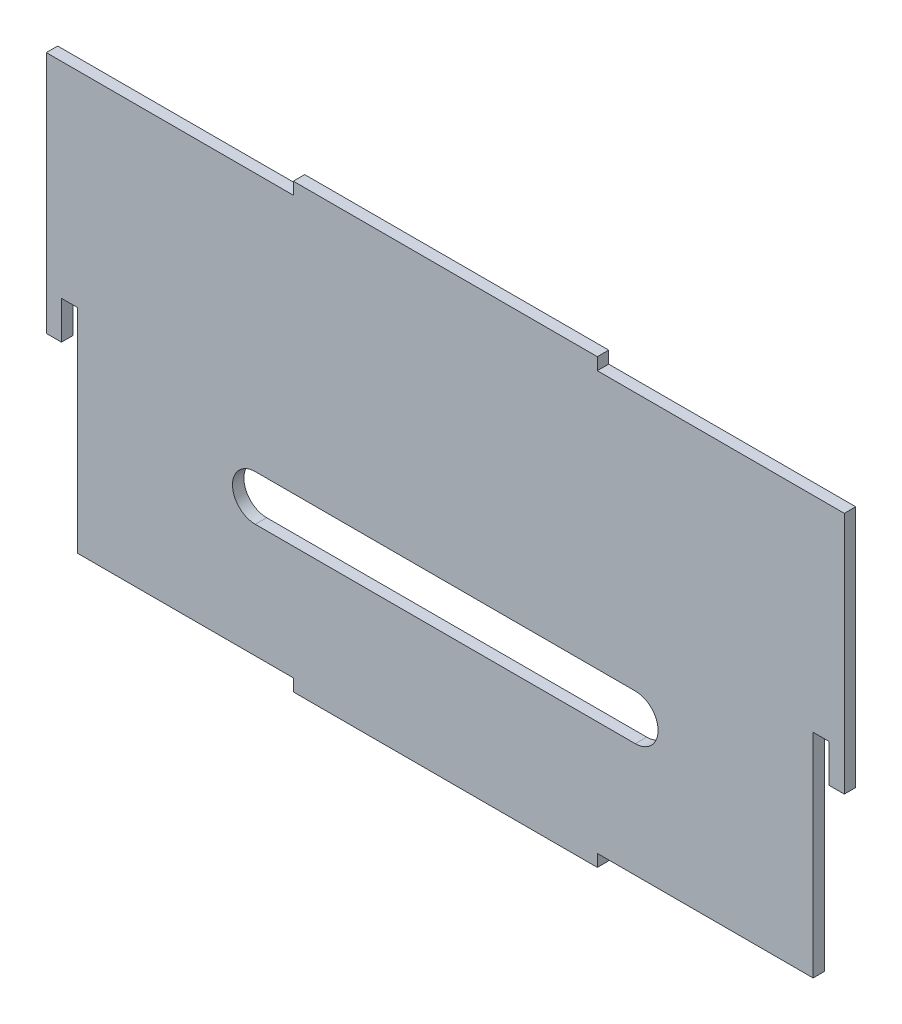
ISO-10303-21;
HEADER;
FILE_DESCRIPTION(('STEP AP214'),'2;1');
FILE_NAME('part.step','',(''),(''),'','','');
FILE_SCHEMA(('AUTOMOTIVE_DESIGN { 1 0 10303 214 1 1 1 1 }'));
ENDSEC;
DATA;
#1=APPLICATION_CONTEXT('core data for automotive mechanical design processes');
#2=APPLICATION_PROTOCOL_DEFINITION('international standard','automotive_design',2000,#1);
#3=PRODUCT_CONTEXT('',#1,'mechanical');
#4=PRODUCT('Part','Part','',(#3));
#5=PRODUCT_RELATED_PRODUCT_CATEGORY('part','',(#4));
#6=PRODUCT_DEFINITION_FORMATION('','',#4);
#7=PRODUCT_DEFINITION_CONTEXT('part definition',#1,'design');
#8=PRODUCT_DEFINITION('design','',#6,#7);
#9=PRODUCT_DEFINITION_SHAPE('','',#8);
#10=(LENGTH_UNIT() NAMED_UNIT(*) SI_UNIT(.MILLI.,.METRE.));
#11=(NAMED_UNIT(*) PLANE_ANGLE_UNIT() SI_UNIT($,.RADIAN.));
#12=(NAMED_UNIT(*) SI_UNIT($,.STERADIAN.) SOLID_ANGLE_UNIT());
#13=UNCERTAINTY_MEASURE_WITH_UNIT(LENGTH_MEASURE(1.E-05),#10,'distance_accuracy_value','');
#14=(GEOMETRIC_REPRESENTATION_CONTEXT(3) GLOBAL_UNCERTAINTY_ASSIGNED_CONTEXT((#13)) GLOBAL_UNIT_ASSIGNED_CONTEXT((#10,
#11,#12)) REPRESENTATION_CONTEXT('',''));
#15=CARTESIAN_POINT('',(0.,0.,0.));
#16=DIRECTION('',(0.,0.,1.));
#17=DIRECTION('',(1.,0.,0.));
#18=AXIS2_PLACEMENT_3D('',#15,#16,#17);
#19=CARTESIAN_POINT('',(0.,0.,1.5));
#20=DIRECTION('',(0.,0.,1.));
#21=DIRECTION('',(1.,0.,0.));
#22=AXIS2_PLACEMENT_3D('',#19,#20,#21);
#23=PLANE('',#22);
#24=DIRECTION('',(-1.,0.,0.));
#25=VECTOR('',#24,1.);
#26=CARTESIAN_POINT('',(-52.5,-4.5,1.5));
#27=LINE('',#26,#25);
#28=CARTESIAN_POINT('',(-50.5,-4.5,1.5));
#29=VERTEX_POINT('',#28);
#30=CARTESIAN_POINT('',(-52.5,-4.5,1.5));
#31=VERTEX_POINT('',#30);
#32=EDGE_CURVE('E198',#29,#31,#27,.T.);
#33=ORIENTED_EDGE('',*,*,#32,.F.);
#34=DIRECTION('',(0.,1.,0.));
#35=VECTOR('',#34,1.);
#36=CARTESIAN_POINT('',(-50.5,-27.5,1.5));
#37=LINE('',#36,#35);
#38=CARTESIAN_POINT('',(-50.5,0.499999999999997,1.5));
#39=VERTEX_POINT('',#38);
#40=EDGE_CURVE('E206',#29,#39,#37,.T.);
#41=ORIENTED_EDGE('',*,*,#40,.T.);
#42=DIRECTION('',(1.,0.,0.));
#43=VECTOR('',#42,1.);
#44=CARTESIAN_POINT('',(-50.5,0.499999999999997,1.5));
#45=LINE('',#44,#43);
#46=CARTESIAN_POINT('',(-48.4,0.499999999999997,1.5));
#47=VERTEX_POINT('',#46);
#48=EDGE_CURVE('E219',#39,#47,#45,.T.);
#49=ORIENTED_EDGE('',*,*,#48,.T.);
#50=DIRECTION('',(0.,-1.,0.));
#51=VECTOR('',#50,1.);
#52=CARTESIAN_POINT('',(-48.4,-27.5,1.5));
#53=LINE('',#52,#51);
#54=CARTESIAN_POINT('',(-48.4,-27.5,1.5));
#55=VERTEX_POINT('',#54);
#56=EDGE_CURVE('E223',#47,#55,#53,.T.);
#57=ORIENTED_EDGE('',*,*,#56,.T.);
#58=DIRECTION('',(1.,0.,0.));
#59=VECTOR('',#58,1.);
#60=CARTESIAN_POINT('',(-48.4,-27.5,1.5));
#61=LINE('',#60,#59);
#62=CARTESIAN_POINT('',(-20.,-27.5,1.5));
#63=VERTEX_POINT('',#62);
#64=EDGE_CURVE('E231',#55,#63,#61,.T.);
#65=ORIENTED_EDGE('',*,*,#64,.T.);
#66=DIRECTION('',(0.,-1.,0.));
#67=VECTOR('',#66,1.);
#68=CARTESIAN_POINT('',(-20.,-27.5,1.5));
#69=LINE('',#68,#67);
#70=CARTESIAN_POINT('',(-20.,-29.1,1.5));
#71=VERTEX_POINT('',#70);
#72=EDGE_CURVE('E234',#63,#71,#69,.T.);
#73=ORIENTED_EDGE('',*,*,#72,.T.);
#74=DIRECTION('',(1.,0.,0.));
#75=VECTOR('',#74,1.);
#76=CARTESIAN_POINT('',(-20.,-29.1,1.5));
#77=LINE('',#76,#75);
#78=CARTESIAN_POINT('',(20.,-29.1,1.5));
#79=VERTEX_POINT('',#78);
#80=EDGE_CURVE('E237',#71,#79,#77,.T.);
#81=ORIENTED_EDGE('',*,*,#80,.T.);
#82=DIRECTION('',(0.,1.,0.));
#83=VECTOR('',#82,1.);
#84=CARTESIAN_POINT('',(20.,-27.5,1.5));
#85=LINE('',#84,#83);
#86=CARTESIAN_POINT('',(20.,-27.5,1.5));
#87=VERTEX_POINT('',#86);
#88=EDGE_CURVE('E240',#79,#87,#85,.T.);
#89=ORIENTED_EDGE('',*,*,#88,.T.);
#90=DIRECTION('',(1.,0.,0.));
#91=VECTOR('',#90,1.);
#92=CARTESIAN_POINT('',(20.,-27.5,1.5));
#93=LINE('',#92,#91);
#94=CARTESIAN_POINT('',(48.4,-27.5,1.5));
#95=VERTEX_POINT('',#94);
#96=EDGE_CURVE('E243',#87,#95,#93,.T.);
#97=ORIENTED_EDGE('',*,*,#96,.T.);
#98=DIRECTION('',(0.,1.,0.));
#99=VECTOR('',#98,1.);
#100=CARTESIAN_POINT('',(48.4,-27.5,1.5));
#101=LINE('',#100,#99);
#102=CARTESIAN_POINT('',(48.4,0.499999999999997,1.5));
#103=VERTEX_POINT('',#102);
#104=EDGE_CURVE('E246',#95,#103,#101,.T.);
#105=ORIENTED_EDGE('',*,*,#104,.T.);
#106=DIRECTION('',(1.,0.,0.));
#107=VECTOR('',#106,1.);
#108=CARTESIAN_POINT('',(50.5,0.499999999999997,1.5));
#109=LINE('',#108,#107);
#110=CARTESIAN_POINT('',(50.5,0.499999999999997,1.5));
#111=VERTEX_POINT('',#110);
#112=EDGE_CURVE('E249',#103,#111,#109,.T.);
#113=ORIENTED_EDGE('',*,*,#112,.T.);
#114=DIRECTION('',(0.,-1.,0.));
#115=VECTOR('',#114,1.);
#116=CARTESIAN_POINT('',(50.5,-27.5,1.5));
#117=LINE('',#116,#115);
#118=CARTESIAN_POINT('',(50.5,-4.5,1.5));
#119=VERTEX_POINT('',#118);
#120=EDGE_CURVE('E252',#111,#119,#117,.T.);
#121=ORIENTED_EDGE('',*,*,#120,.T.);
#122=DIRECTION('',(-1.,0.,0.));
#123=VECTOR('',#122,1.);
#124=CARTESIAN_POINT('',(52.5,-4.5,1.5));
#125=LINE('',#124,#123);
#126=CARTESIAN_POINT('',(52.5,-4.5,1.5));
#127=VERTEX_POINT('',#126);
#128=EDGE_CURVE('E414',#127,#119,#125,.T.);
#129=ORIENTED_EDGE('',*,*,#128,.F.);
#130=DIRECTION('',(0.,1.,0.));
#131=VECTOR('',#130,1.);
#132=CARTESIAN_POINT('',(52.5,27.5,1.5));
#133=LINE('',#132,#131);
#134=CARTESIAN_POINT('',(52.5,27.5,1.5));
#135=VERTEX_POINT('',#134);
#136=EDGE_CURVE('E256',#127,#135,#133,.T.);
#137=ORIENTED_EDGE('',*,*,#136,.T.);
#138=DIRECTION('',(-1.,0.,0.));
#139=VECTOR('',#138,1.);
#140=CARTESIAN_POINT('',(20.,27.5,1.5));
#141=LINE('',#140,#139);
#142=CARTESIAN_POINT('',(20.,27.5,1.5));
#143=VERTEX_POINT('',#142);
#144=EDGE_CURVE('E259',#135,#143,#141,.T.);
#145=ORIENTED_EDGE('',*,*,#144,.T.);
#146=DIRECTION('',(0.,1.,0.));
#147=VECTOR('',#146,1.);
#148=CARTESIAN_POINT('',(20.,27.5,1.5));
#149=LINE('',#148,#147);
#150=CARTESIAN_POINT('',(20.,29.1,1.5));
#151=VERTEX_POINT('',#150);
#152=EDGE_CURVE('E262',#143,#151,#149,.T.);
#153=ORIENTED_EDGE('',*,*,#152,.T.);
#154=DIRECTION('',(-1.,0.,0.));
#155=VECTOR('',#154,1.);
#156=CARTESIAN_POINT('',(-20.,29.1,1.5));
#157=LINE('',#156,#155);
#158=CARTESIAN_POINT('',(-20.,29.1,1.5));
#159=VERTEX_POINT('',#158);
#160=EDGE_CURVE('E265',#151,#159,#157,.T.);
#161=ORIENTED_EDGE('',*,*,#160,.T.);
#162=DIRECTION('',(0.,-1.,0.));
#163=VECTOR('',#162,1.);
#164=CARTESIAN_POINT('',(-20.,27.5,1.5));
#165=LINE('',#164,#163);
#166=CARTESIAN_POINT('',(-20.,27.5,1.5));
#167=VERTEX_POINT('',#166);
#168=EDGE_CURVE('E268',#159,#167,#165,.T.);
#169=ORIENTED_EDGE('',*,*,#168,.T.);
#170=DIRECTION('',(-1.,0.,0.));
#171=VECTOR('',#170,1.);
#172=CARTESIAN_POINT('',(-52.5,27.5,1.5));
#173=LINE('',#172,#171);
#174=CARTESIAN_POINT('',(-52.5,27.5,1.5));
#175=VERTEX_POINT('',#174);
#176=EDGE_CURVE('E225',#167,#175,#173,.T.);
#177=ORIENTED_EDGE('',*,*,#176,.T.);
#178=DIRECTION('',(0.,-1.,0.));
#179=VECTOR('',#178,1.);
#180=CARTESIAN_POINT('',(-52.5,27.5,1.5));
#181=LINE('',#180,#179);
#182=EDGE_CURVE('E209',#175,#31,#181,.T.);
#183=ORIENTED_EDGE('',*,*,#182,.T.);
#184=EDGE_LOOP('',(#33,#41,#49,#57,#65,#73,#81,#89,#97,#105,#113,#121,#129,#137,#145,#153,#161,
#169,#177,#183));
#185=FACE_BOUND('',#184,.T.);
#186=DIRECTION('',(-1.,0.,0.));
#187=VECTOR('',#186,1.);
#188=CARTESIAN_POINT('',(0.,-12.5,1.5));
#189=LINE('',#188,#187);
#190=CARTESIAN_POINT('',(25.,-12.5,1.5));
#191=VERTEX_POINT('',#190);
#192=CARTESIAN_POINT('',(-25.,-12.5,1.5));
#193=VERTEX_POINT('',#192);
#194=EDGE_CURVE('E463',#191,#193,#189,.T.);
#195=ORIENTED_EDGE('',*,*,#194,.T.);
#196=CARTESIAN_POINT('',(-25.,-9.50000000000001,1.5));
#197=DIRECTION('',(0.,0.,1.));
#198=DIRECTION('',(1.,0.,0.));
#199=AXIS2_PLACEMENT_3D('',#196,#197,#198);
#200=CIRCLE('',#199,3.);
#201=CARTESIAN_POINT('',(-25.,-6.50000000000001,1.5));
#202=VERTEX_POINT('',#201);
#203=EDGE_CURVE('E277',#193,#202,#200,.F.);
#204=ORIENTED_EDGE('',*,*,#203,.T.);
#205=DIRECTION('',(-1.,0.,0.));
#206=VECTOR('',#205,1.);
#207=CARTESIAN_POINT('',(0.,-6.50000000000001,1.5));
#208=LINE('',#207,#206);
#209=CARTESIAN_POINT('',(25.,-6.50000000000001,1.5));
#210=VERTEX_POINT('',#209);
#211=EDGE_CURVE('E456',#210,#202,#208,.T.);
#212=ORIENTED_EDGE('',*,*,#211,.F.);
#213=CARTESIAN_POINT('',(25.,-9.50000000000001,1.5));
#214=DIRECTION('',(0.,0.,1.));
#215=DIRECTION('',(1.,0.,0.));
#216=AXIS2_PLACEMENT_3D('',#213,#214,#215);
#217=CIRCLE('',#216,3.);
#218=EDGE_CURVE('E459',#210,#191,#217,.F.);
#219=ORIENTED_EDGE('',*,*,#218,.T.);
#220=EDGE_LOOP('',(#195,#204,#212,#219));
#221=FACE_BOUND('',#220,.T.);
#222=ADVANCED_FACE('F38',(#185,#221),#23,.T.);
#223=CARTESIAN_POINT('',(0.,0.,0.));
#224=DIRECTION('',(0.,0.,1.));
#225=DIRECTION('',(1.,0.,0.));
#226=AXIS2_PLACEMENT_3D('',#223,#224,#225);
#227=PLANE('',#226);
#228=DIRECTION('',(0.,1.,0.));
#229=VECTOR('',#228,1.);
#230=CARTESIAN_POINT('',(-50.5,-27.5,0.));
#231=LINE('',#230,#229);
#232=CARTESIAN_POINT('',(-50.5,-4.5,0.));
#233=VERTEX_POINT('',#232);
#234=CARTESIAN_POINT('',(-50.5,0.499999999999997,0.));
#235=VERTEX_POINT('',#234);
#236=EDGE_CURVE('E281',#233,#235,#231,.T.);
#237=ORIENTED_EDGE('',*,*,#236,.F.);
#238=DIRECTION('',(-1.,0.,0.));
#239=VECTOR('',#238,1.);
#240=CARTESIAN_POINT('',(0.,-4.50000000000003,0.));
#241=LINE('',#240,#239);
#242=CARTESIAN_POINT('',(-52.5,-4.5,0.));
#243=VERTEX_POINT('',#242);
#244=EDGE_CURVE('E54',#233,#243,#241,.T.);
#245=ORIENTED_EDGE('',*,*,#244,.T.);
#246=DIRECTION('',(0.,-1.,0.));
#247=VECTOR('',#246,1.);
#248=CARTESIAN_POINT('',(-52.5,27.5,0.));
#249=LINE('',#248,#247);
#250=CARTESIAN_POINT('',(-52.5,27.5,0.));
#251=VERTEX_POINT('',#250);
#252=EDGE_CURVE('E276',#251,#243,#249,.T.);
#253=ORIENTED_EDGE('',*,*,#252,.F.);
#254=DIRECTION('',(-1.,0.,0.));
#255=VECTOR('',#254,1.);
#256=CARTESIAN_POINT('',(-52.5,27.5,0.));
#257=LINE('',#256,#255);
#258=CARTESIAN_POINT('',(-20.,27.5,0.));
#259=VERTEX_POINT('',#258);
#260=EDGE_CURVE('E272',#259,#251,#257,.T.);
#261=ORIENTED_EDGE('',*,*,#260,.F.);
#262=DIRECTION('',(0.,-1.,0.));
#263=VECTOR('',#262,1.);
#264=CARTESIAN_POINT('',(-20.,27.5,0.));
#265=LINE('',#264,#263);
#266=CARTESIAN_POINT('',(-20.,29.1,0.));
#267=VERTEX_POINT('',#266);
#268=EDGE_CURVE('E327',#267,#259,#265,.T.);
#269=ORIENTED_EDGE('',*,*,#268,.F.);
#270=DIRECTION('',(-1.,0.,0.));
#271=VECTOR('',#270,1.);
#272=CARTESIAN_POINT('',(-20.,29.1,0.));
#273=LINE('',#272,#271);
#274=CARTESIAN_POINT('',(20.,29.1,0.));
#275=VERTEX_POINT('',#274);
#276=EDGE_CURVE('E324',#275,#267,#273,.T.);
#277=ORIENTED_EDGE('',*,*,#276,.F.);
#278=DIRECTION('',(0.,1.,0.));
#279=VECTOR('',#278,1.);
#280=CARTESIAN_POINT('',(20.,27.5,0.));
#281=LINE('',#280,#279);
#282=CARTESIAN_POINT('',(20.,27.5,0.));
#283=VERTEX_POINT('',#282);
#284=EDGE_CURVE('E321',#283,#275,#281,.T.);
#285=ORIENTED_EDGE('',*,*,#284,.F.);
#286=DIRECTION('',(-1.,0.,0.));
#287=VECTOR('',#286,1.);
#288=CARTESIAN_POINT('',(20.,27.5,0.));
#289=LINE('',#288,#287);
#290=CARTESIAN_POINT('',(52.5,27.5,0.));
#291=VERTEX_POINT('',#290);
#292=EDGE_CURVE('E318',#291,#283,#289,.T.);
#293=ORIENTED_EDGE('',*,*,#292,.F.);
#294=DIRECTION('',(0.,1.,0.));
#295=VECTOR('',#294,1.);
#296=CARTESIAN_POINT('',(52.5,27.5,0.));
#297=LINE('',#296,#295);
#298=CARTESIAN_POINT('',(52.5,-4.5,0.));
#299=VERTEX_POINT('',#298);
#300=EDGE_CURVE('E315',#299,#291,#297,.T.);
#301=ORIENTED_EDGE('',*,*,#300,.F.);
#302=DIRECTION('',(-1.,0.,0.));
#303=VECTOR('',#302,1.);
#304=CARTESIAN_POINT('',(0.,-4.50000000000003,0.));
#305=LINE('',#304,#303);
#306=CARTESIAN_POINT('',(50.5,-4.5,0.));
#307=VERTEX_POINT('',#306);
#308=EDGE_CURVE('E61',#299,#307,#305,.T.);
#309=ORIENTED_EDGE('',*,*,#308,.T.);
#310=DIRECTION('',(0.,-1.,0.));
#311=VECTOR('',#310,1.);
#312=CARTESIAN_POINT('',(50.5,-27.5,0.));
#313=LINE('',#312,#311);
#314=CARTESIAN_POINT('',(50.5,0.499999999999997,0.));
#315=VERTEX_POINT('',#314);
#316=EDGE_CURVE('E311',#315,#307,#313,.T.);
#317=ORIENTED_EDGE('',*,*,#316,.F.);
#318=DIRECTION('',(1.,0.,0.));
#319=VECTOR('',#318,1.);
#320=CARTESIAN_POINT('',(50.5,0.499999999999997,0.));
#321=LINE('',#320,#319);
#322=CARTESIAN_POINT('',(48.4,0.499999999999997,0.));
#323=VERTEX_POINT('',#322);
#324=EDGE_CURVE('E308',#323,#315,#321,.T.);
#325=ORIENTED_EDGE('',*,*,#324,.F.);
#326=DIRECTION('',(0.,1.,0.));
#327=VECTOR('',#326,1.);
#328=CARTESIAN_POINT('',(48.4,-27.5,0.));
#329=LINE('',#328,#327);
#330=CARTESIAN_POINT('',(48.4,-27.5,0.));
#331=VERTEX_POINT('',#330);
#332=EDGE_CURVE('E305',#331,#323,#329,.T.);
#333=ORIENTED_EDGE('',*,*,#332,.F.);
#334=DIRECTION('',(1.,0.,0.));
#335=VECTOR('',#334,1.);
#336=CARTESIAN_POINT('',(20.,-27.5,0.));
#337=LINE('',#336,#335);
#338=CARTESIAN_POINT('',(20.,-27.5,0.));
#339=VERTEX_POINT('',#338);
#340=EDGE_CURVE('E302',#339,#331,#337,.T.);
#341=ORIENTED_EDGE('',*,*,#340,.F.);
#342=DIRECTION('',(0.,1.,0.));
#343=VECTOR('',#342,1.);
#344=CARTESIAN_POINT('',(20.,-27.5,0.));
#345=LINE('',#344,#343);
#346=CARTESIAN_POINT('',(20.,-29.1,0.));
#347=VERTEX_POINT('',#346);
#348=EDGE_CURVE('E299',#347,#339,#345,.T.);
#349=ORIENTED_EDGE('',*,*,#348,.F.);
#350=DIRECTION('',(1.,0.,0.));
#351=VECTOR('',#350,1.);
#352=CARTESIAN_POINT('',(-20.,-29.1,0.));
#353=LINE('',#352,#351);
#354=CARTESIAN_POINT('',(-20.,-29.1,0.));
#355=VERTEX_POINT('',#354);
#356=EDGE_CURVE('E296',#355,#347,#353,.T.);
#357=ORIENTED_EDGE('',*,*,#356,.F.);
#358=DIRECTION('',(0.,-1.,0.));
#359=VECTOR('',#358,1.);
#360=CARTESIAN_POINT('',(-20.,-27.5,0.));
#361=LINE('',#360,#359);
#362=CARTESIAN_POINT('',(-20.,-27.5,0.));
#363=VERTEX_POINT('',#362);
#364=EDGE_CURVE('E293',#363,#355,#361,.T.);
#365=ORIENTED_EDGE('',*,*,#364,.F.);
#366=DIRECTION('',(1.,0.,0.));
#367=VECTOR('',#366,1.);
#368=CARTESIAN_POINT('',(-48.4,-27.5,0.));
#369=LINE('',#368,#367);
#370=CARTESIAN_POINT('',(-48.4,-27.5,0.));
#371=VERTEX_POINT('',#370);
#372=EDGE_CURVE('E290',#371,#363,#369,.T.);
#373=ORIENTED_EDGE('',*,*,#372,.F.);
#374=DIRECTION('',(0.,-1.,0.));
#375=VECTOR('',#374,1.);
#376=CARTESIAN_POINT('',(-48.4,-27.5,0.));
#377=LINE('',#376,#375);
#378=CARTESIAN_POINT('',(-48.4,0.499999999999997,0.));
#379=VERTEX_POINT('',#378);
#380=EDGE_CURVE('E287',#379,#371,#377,.T.);
#381=ORIENTED_EDGE('',*,*,#380,.F.);
#382=DIRECTION('',(1.,0.,0.));
#383=VECTOR('',#382,1.);
#384=CARTESIAN_POINT('',(-50.5,0.499999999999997,0.));
#385=LINE('',#384,#383);
#386=EDGE_CURVE('E284',#235,#379,#385,.T.);
#387=ORIENTED_EDGE('',*,*,#386,.F.);
#388=EDGE_LOOP('',(#237,#245,#253,#261,#269,#277,#285,#293,#301,#309,#317,#325,#333,#341,#349,
#357,#365,#373,#381,#387));
#389=FACE_BOUND('',#388,.T.);
#390=CARTESIAN_POINT('',(-25.,-9.50000000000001,0.));
#391=DIRECTION('',(0.,0.,1.));
#392=DIRECTION('',(1.,0.,0.));
#393=AXIS2_PLACEMENT_3D('',#390,#391,#392);
#394=CIRCLE('',#393,3.);
#395=CARTESIAN_POINT('',(-25.,-6.50000000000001,0.));
#396=VERTEX_POINT('',#395);
#397=CARTESIAN_POINT('',(-25.,-12.5,0.));
#398=VERTEX_POINT('',#397);
#399=EDGE_CURVE('E427',#396,#398,#394,.T.);
#400=ORIENTED_EDGE('',*,*,#399,.T.);
#401=DIRECTION('',(1.,0.,0.));
#402=VECTOR('',#401,1.);
#403=CARTESIAN_POINT('',(-25.,-12.5,0.));
#404=LINE('',#403,#402);
#405=CARTESIAN_POINT('',(25.,-12.5,0.));
#406=VERTEX_POINT('',#405);
#407=EDGE_CURVE('E431',#398,#406,#404,.T.);
#408=ORIENTED_EDGE('',*,*,#407,.T.);
#409=CARTESIAN_POINT('',(25.,-9.50000000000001,0.));
#410=DIRECTION('',(0.,0.,1.));
#411=DIRECTION('',(1.,0.,0.));
#412=AXIS2_PLACEMENT_3D('',#409,#410,#411);
#413=CIRCLE('',#412,3.);
#414=CARTESIAN_POINT('',(25.,-6.50000000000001,0.));
#415=VERTEX_POINT('',#414);
#416=EDGE_CURVE('E435',#406,#415,#413,.T.);
#417=ORIENTED_EDGE('',*,*,#416,.T.);
#418=DIRECTION('',(1.,0.,0.));
#419=VECTOR('',#418,1.);
#420=CARTESIAN_POINT('',(-25.,-6.50000000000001,0.));
#421=LINE('',#420,#419);
#422=EDGE_CURVE('E439',#396,#415,#421,.T.);
#423=ORIENTED_EDGE('',*,*,#422,.F.);
#424=EDGE_LOOP('',(#400,#408,#417,#423));
#425=FACE_BOUND('',#424,.T.);
#426=ADVANCED_FACE('F399',(#389,#425),#227,.F.);
#427=CARTESIAN_POINT('',(-52.5,27.5,1.5));
#428=DIRECTION('',(0.,-1.,0.));
#429=DIRECTION('',(1.,0.,0.));
#430=AXIS2_PLACEMENT_3D('',#427,#428,#429);
#431=PLANE('',#430);
#432=ORIENTED_EDGE('',*,*,#260,.T.);
#433=DIRECTION('',(0.,0.,-1.));
#434=VECTOR('',#433,1.);
#435=CARTESIAN_POINT('',(-52.5,27.5,1.5));
#436=LINE('',#435,#434);
#437=EDGE_CURVE('E387',#175,#251,#436,.T.);
#438=ORIENTED_EDGE('',*,*,#437,.F.);
#439=ORIENTED_EDGE('',*,*,#176,.F.);
#440=DIRECTION('',(0.,0.,-1.));
#441=VECTOR('',#440,1.);
#442=CARTESIAN_POINT('',(-20.,27.5,1.5));
#443=LINE('',#442,#441);
#444=EDGE_CURVE('E271',#167,#259,#443,.T.);
#445=ORIENTED_EDGE('',*,*,#444,.T.);
#446=EDGE_LOOP('',(#432,#438,#439,#445));
#447=FACE_BOUND('',#446,.T.);
#448=ADVANCED_FACE('F40',(#447),#431,.F.);
#449=CARTESIAN_POINT('',(-52.5,27.5,1.5));
#450=DIRECTION('',(1.,0.,0.));
#451=DIRECTION('',(0.,0.,-1.));
#452=AXIS2_PLACEMENT_3D('',#449,#450,#451);
#453=PLANE('',#452);
#454=ORIENTED_EDGE('',*,*,#252,.T.);
#455=DIRECTION('',(0.,0.,1.));
#456=VECTOR('',#455,1.);
#457=CARTESIAN_POINT('',(-52.5,-4.5,-8.5));
#458=LINE('',#457,#456);
#459=EDGE_CURVE('E211',#243,#31,#458,.T.);
#460=ORIENTED_EDGE('',*,*,#459,.T.);
#461=ORIENTED_EDGE('',*,*,#182,.F.);
#462=ORIENTED_EDGE('',*,*,#437,.T.);
#463=EDGE_LOOP('',(#454,#460,#461,#462));
#464=FACE_BOUND('',#463,.T.);
#465=ADVANCED_FACE('F477',(#464),#453,.F.);
#466=CARTESIAN_POINT('',(-50.5,-27.5,1.5));
#467=DIRECTION('',(-1.,0.,0.));
#468=DIRECTION('',(0.,-1.,0.));
#469=AXIS2_PLACEMENT_3D('',#466,#467,#468);
#470=PLANE('',#469);
#471=ORIENTED_EDGE('',*,*,#40,.F.);
#472=DIRECTION('',(0.,0.,-1.));
#473=VECTOR('',#472,1.);
#474=CARTESIAN_POINT('',(-50.5,-4.5,1.5));
#475=LINE('',#474,#473);
#476=EDGE_CURVE('E11',#29,#233,#475,.T.);
#477=ORIENTED_EDGE('',*,*,#476,.T.);
#478=ORIENTED_EDGE('',*,*,#236,.T.);
#479=DIRECTION('',(0.,0.,-1.));
#480=VECTOR('',#479,1.);
#481=CARTESIAN_POINT('',(-50.5,0.499999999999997,1.5));
#482=LINE('',#481,#480);
#483=EDGE_CURVE('E216',#39,#235,#482,.T.);
#484=ORIENTED_EDGE('',*,*,#483,.F.);
#485=EDGE_LOOP('',(#471,#477,#478,#484));
#486=FACE_BOUND('',#485,.T.);
#487=ADVANCED_FACE('F214',(#486),#470,.F.);
#488=CARTESIAN_POINT('',(-50.5,0.499999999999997,1.5));
#489=DIRECTION('',(0.,1.,0.));
#490=DIRECTION('',(0.,0.,1.));
#491=AXIS2_PLACEMENT_3D('',#488,#489,#490);
#492=PLANE('',#491);
#493=ORIENTED_EDGE('',*,*,#386,.T.);
#494=DIRECTION('',(0.,0.,-1.));
#495=VECTOR('',#494,1.);
#496=CARTESIAN_POINT('',(-48.4,0.499999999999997,1.5));
#497=LINE('',#496,#495);
#498=EDGE_CURVE('E381',#47,#379,#497,.T.);
#499=ORIENTED_EDGE('',*,*,#498,.F.);
#500=ORIENTED_EDGE('',*,*,#48,.F.);
#501=ORIENTED_EDGE('',*,*,#483,.T.);
#502=EDGE_LOOP('',(#493,#499,#500,#501));
#503=FACE_BOUND('',#502,.T.);
#504=ADVANCED_FACE('F482',(#503),#492,.F.);
#505=CARTESIAN_POINT('',(-48.4,-27.5,1.5));
#506=DIRECTION('',(1.,0.,0.));
#507=DIRECTION('',(0.,0.,-1.));
#508=AXIS2_PLACEMENT_3D('',#505,#506,#507);
#509=PLANE('',#508);
#510=ORIENTED_EDGE('',*,*,#380,.T.);
#511=DIRECTION('',(0.,0.,-1.));
#512=VECTOR('',#511,1.);
#513=CARTESIAN_POINT('',(-48.4,-27.5,1.5));
#514=LINE('',#513,#512);
#515=EDGE_CURVE('E377',#55,#371,#514,.T.);
#516=ORIENTED_EDGE('',*,*,#515,.F.);
#517=ORIENTED_EDGE('',*,*,#56,.F.);
#518=ORIENTED_EDGE('',*,*,#498,.T.);
#519=EDGE_LOOP('',(#510,#516,#517,#518));
#520=FACE_BOUND('',#519,.T.);
#521=ADVANCED_FACE('F489',(#520),#509,.F.);
#522=CARTESIAN_POINT('',(-48.4,-27.5,1.5));
#523=DIRECTION('',(0.,1.,0.));
#524=DIRECTION('',(-1.,0.,0.));
#525=AXIS2_PLACEMENT_3D('',#522,#523,#524);
#526=PLANE('',#525);
#527=ORIENTED_EDGE('',*,*,#372,.T.);
#528=DIRECTION('',(0.,0.,-1.));
#529=VECTOR('',#528,1.);
#530=CARTESIAN_POINT('',(-20.,-27.5,1.5));
#531=LINE('',#530,#529);
#532=EDGE_CURVE('E373',#63,#363,#531,.T.);
#533=ORIENTED_EDGE('',*,*,#532,.F.);
#534=ORIENTED_EDGE('',*,*,#64,.F.);
#535=ORIENTED_EDGE('',*,*,#515,.T.);
#536=EDGE_LOOP('',(#527,#533,#534,#535));
#537=FACE_BOUND('',#536,.T.);
#538=ADVANCED_FACE('F492',(#537),#526,.F.);
#539=CARTESIAN_POINT('',(-20.,-27.5,1.5));
#540=DIRECTION('',(1.,0.,0.));
#541=DIRECTION('',(0.,0.,-1.));
#542=AXIS2_PLACEMENT_3D('',#539,#540,#541);
#543=PLANE('',#542);
#544=ORIENTED_EDGE('',*,*,#364,.T.);
#545=DIRECTION('',(0.,0.,-1.));
#546=VECTOR('',#545,1.);
#547=CARTESIAN_POINT('',(-20.,-29.1,1.5));
#548=LINE('',#547,#546);
#549=EDGE_CURVE('E369',#71,#355,#548,.T.);
#550=ORIENTED_EDGE('',*,*,#549,.F.);
#551=ORIENTED_EDGE('',*,*,#72,.F.);
#552=ORIENTED_EDGE('',*,*,#532,.T.);
#553=EDGE_LOOP('',(#544,#550,#551,#552));
#554=FACE_BOUND('',#553,.T.);
#555=ADVANCED_FACE('F497',(#554),#543,.F.);
#556=CARTESIAN_POINT('',(-20.,-29.1,1.5));
#557=DIRECTION('',(0.,1.,0.));
#558=DIRECTION('',(-1.,0.,0.));
#559=AXIS2_PLACEMENT_3D('',#556,#557,#558);
#560=PLANE('',#559);
#561=ORIENTED_EDGE('',*,*,#356,.T.);
#562=DIRECTION('',(0.,0.,-1.));
#563=VECTOR('',#562,1.);
#564=CARTESIAN_POINT('',(20.,-29.1,1.5));
#565=LINE('',#564,#563);
#566=EDGE_CURVE('E365',#79,#347,#565,.T.);
#567=ORIENTED_EDGE('',*,*,#566,.F.);
#568=ORIENTED_EDGE('',*,*,#80,.F.);
#569=ORIENTED_EDGE('',*,*,#549,.T.);
#570=EDGE_LOOP('',(#561,#567,#568,#569));
#571=FACE_BOUND('',#570,.T.);
#572=ADVANCED_FACE('F503',(#571),#560,.F.);
#573=CARTESIAN_POINT('',(20.,-27.5,1.5));
#574=DIRECTION('',(-1.,0.,0.));
#575=DIRECTION('',(0.,0.,1.));
#576=AXIS2_PLACEMENT_3D('',#573,#574,#575);
#577=PLANE('',#576);
#578=ORIENTED_EDGE('',*,*,#348,.T.);
#579=DIRECTION('',(0.,0.,-1.));
#580=VECTOR('',#579,1.);
#581=CARTESIAN_POINT('',(20.,-27.5,1.5));
#582=LINE('',#581,#580);
#583=EDGE_CURVE('E361',#87,#339,#582,.T.);
#584=ORIENTED_EDGE('',*,*,#583,.F.);
#585=ORIENTED_EDGE('',*,*,#88,.F.);
#586=ORIENTED_EDGE('',*,*,#566,.T.);
#587=EDGE_LOOP('',(#578,#584,#585,#586));
#588=FACE_BOUND('',#587,.T.);
#589=ADVANCED_FACE('F507',(#588),#577,.F.);
#590=CARTESIAN_POINT('',(20.,-27.5,1.5));
#591=DIRECTION('',(0.,1.,0.));
#592=DIRECTION('',(-1.,0.,0.));
#593=AXIS2_PLACEMENT_3D('',#590,#591,#592);
#594=PLANE('',#593);
#595=ORIENTED_EDGE('',*,*,#340,.T.);
#596=DIRECTION('',(0.,0.,-1.));
#597=VECTOR('',#596,1.);
#598=CARTESIAN_POINT('',(48.4,-27.5,1.5));
#599=LINE('',#598,#597);
#600=EDGE_CURVE('E357',#95,#331,#599,.T.);
#601=ORIENTED_EDGE('',*,*,#600,.F.);
#602=ORIENTED_EDGE('',*,*,#96,.F.);
#603=ORIENTED_EDGE('',*,*,#583,.T.);
#604=EDGE_LOOP('',(#595,#601,#602,#603));
#605=FACE_BOUND('',#604,.T.);
#606=ADVANCED_FACE('F512',(#605),#594,.F.);
#607=CARTESIAN_POINT('',(48.4,-27.5,1.5));
#608=DIRECTION('',(-1.,0.,0.));
#609=DIRECTION('',(0.,0.,1.));
#610=AXIS2_PLACEMENT_3D('',#607,#608,#609);
#611=PLANE('',#610);
#612=ORIENTED_EDGE('',*,*,#332,.T.);
#613=DIRECTION('',(0.,0.,-1.));
#614=VECTOR('',#613,1.);
#615=CARTESIAN_POINT('',(48.4,0.499999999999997,1.5));
#616=LINE('',#615,#614);
#617=EDGE_CURVE('E353',#103,#323,#616,.T.);
#618=ORIENTED_EDGE('',*,*,#617,.F.);
#619=ORIENTED_EDGE('',*,*,#104,.F.);
#620=ORIENTED_EDGE('',*,*,#600,.T.);
#621=EDGE_LOOP('',(#612,#618,#619,#620));
#622=FACE_BOUND('',#621,.T.);
#623=ADVANCED_FACE('F518',(#622),#611,.F.);
#624=CARTESIAN_POINT('',(50.5,0.499999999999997,1.5));
#625=DIRECTION('',(0.,1.,0.));
#626=DIRECTION('',(0.,0.,1.));
#627=AXIS2_PLACEMENT_3D('',#624,#625,#626);
#628=PLANE('',#627);
#629=ORIENTED_EDGE('',*,*,#324,.T.);
#630=DIRECTION('',(0.,0.,-1.));
#631=VECTOR('',#630,1.);
#632=CARTESIAN_POINT('',(50.5,0.499999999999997,1.5));
#633=LINE('',#632,#631);
#634=EDGE_CURVE('E349',#111,#315,#633,.T.);
#635=ORIENTED_EDGE('',*,*,#634,.F.);
#636=ORIENTED_EDGE('',*,*,#112,.F.);
#637=ORIENTED_EDGE('',*,*,#617,.T.);
#638=EDGE_LOOP('',(#629,#635,#636,#637));
#639=FACE_BOUND('',#638,.T.);
#640=ADVANCED_FACE('F522',(#639),#628,.F.);
#641=CARTESIAN_POINT('',(50.5,-27.5,1.5));
#642=DIRECTION('',(1.,0.,0.));
#643=DIRECTION('',(0.,1.,0.));
#644=AXIS2_PLACEMENT_3D('',#641,#642,#643);
#645=PLANE('',#644);
#646=ORIENTED_EDGE('',*,*,#316,.T.);
#647=DIRECTION('',(0.,0.,1.));
#648=VECTOR('',#647,1.);
#649=CARTESIAN_POINT('',(50.5,-4.5,-8.5));
#650=LINE('',#649,#648);
#651=EDGE_CURVE('E212',#307,#119,#650,.T.);
#652=ORIENTED_EDGE('',*,*,#651,.T.);
#653=ORIENTED_EDGE('',*,*,#120,.F.);
#654=ORIENTED_EDGE('',*,*,#634,.T.);
#655=EDGE_LOOP('',(#646,#652,#653,#654));
#656=FACE_BOUND('',#655,.T.);
#657=ADVANCED_FACE('F524',(#656),#645,.F.);
#658=CARTESIAN_POINT('',(52.5,27.5,1.5));
#659=DIRECTION('',(-1.,0.,0.));
#660=DIRECTION('',(0.,-1.,0.));
#661=AXIS2_PLACEMENT_3D('',#658,#659,#660);
#662=PLANE('',#661);
#663=ORIENTED_EDGE('',*,*,#136,.F.);
#664=DIRECTION('',(0.,0.,-1.));
#665=VECTOR('',#664,1.);
#666=CARTESIAN_POINT('',(52.5,-4.5,1.5));
#667=LINE('',#666,#665);
#668=EDGE_CURVE('E47',#127,#299,#667,.T.);
#669=ORIENTED_EDGE('',*,*,#668,.T.);
#670=ORIENTED_EDGE('',*,*,#300,.T.);
#671=DIRECTION('',(0.,0.,-1.));
#672=VECTOR('',#671,1.);
#673=CARTESIAN_POINT('',(52.5,27.5,1.5));
#674=LINE('',#673,#672);
#675=EDGE_CURVE('E345',#135,#291,#674,.T.);
#676=ORIENTED_EDGE('',*,*,#675,.F.);
#677=EDGE_LOOP('',(#663,#669,#670,#676));
#678=FACE_BOUND('',#677,.T.);
#679=ADVANCED_FACE('F394',(#678),#662,.F.);
#680=CARTESIAN_POINT('',(20.,27.5,1.5));
#681=DIRECTION('',(0.,-1.,0.));
#682=DIRECTION('',(1.,0.,0.));
#683=AXIS2_PLACEMENT_3D('',#680,#681,#682);
#684=PLANE('',#683);
#685=ORIENTED_EDGE('',*,*,#292,.T.);
#686=DIRECTION('',(0.,0.,-1.));
#687=VECTOR('',#686,1.);
#688=CARTESIAN_POINT('',(20.,27.5,1.5));
#689=LINE('',#688,#687);
#690=EDGE_CURVE('E341',#143,#283,#689,.T.);
#691=ORIENTED_EDGE('',*,*,#690,.F.);
#692=ORIENTED_EDGE('',*,*,#144,.F.);
#693=ORIENTED_EDGE('',*,*,#675,.T.);
#694=EDGE_LOOP('',(#685,#691,#692,#693));
#695=FACE_BOUND('',#694,.T.);
#696=ADVANCED_FACE('F406',(#695),#684,.F.);
#697=CARTESIAN_POINT('',(20.,27.5,1.5));
#698=DIRECTION('',(-1.,0.,0.));
#699=DIRECTION('',(0.,0.,1.));
#700=AXIS2_PLACEMENT_3D('',#697,#698,#699);
#701=PLANE('',#700);
#702=ORIENTED_EDGE('',*,*,#284,.T.);
#703=DIRECTION('',(0.,0.,-1.));
#704=VECTOR('',#703,1.);
#705=CARTESIAN_POINT('',(20.,29.1,1.5));
#706=LINE('',#705,#704);
#707=EDGE_CURVE('E337',#151,#275,#706,.T.);
#708=ORIENTED_EDGE('',*,*,#707,.F.);
#709=ORIENTED_EDGE('',*,*,#152,.F.);
#710=ORIENTED_EDGE('',*,*,#690,.T.);
#711=EDGE_LOOP('',(#702,#708,#709,#710));
#712=FACE_BOUND('',#711,.T.);
#713=ADVANCED_FACE('F410',(#712),#701,.F.);
#714=CARTESIAN_POINT('',(-20.,29.1,1.5));
#715=DIRECTION('',(0.,-1.,0.));
#716=DIRECTION('',(1.,0.,0.));
#717=AXIS2_PLACEMENT_3D('',#714,#715,#716);
#718=PLANE('',#717);
#719=ORIENTED_EDGE('',*,*,#276,.T.);
#720=DIRECTION('',(0.,0.,-1.));
#721=VECTOR('',#720,1.);
#722=CARTESIAN_POINT('',(-20.,29.1,1.5));
#723=LINE('',#722,#721);
#724=EDGE_CURVE('E333',#159,#267,#723,.T.);
#725=ORIENTED_EDGE('',*,*,#724,.F.);
#726=ORIENTED_EDGE('',*,*,#160,.F.);
#727=ORIENTED_EDGE('',*,*,#707,.T.);
#728=EDGE_LOOP('',(#719,#725,#726,#727));
#729=FACE_BOUND('',#728,.T.);
#730=ADVANCED_FACE('F551',(#729),#718,.F.);
#731=CARTESIAN_POINT('',(-20.,27.5,1.5));
#732=DIRECTION('',(1.,0.,0.));
#733=DIRECTION('',(0.,0.,-1.));
#734=AXIS2_PLACEMENT_3D('',#731,#732,#733);
#735=PLANE('',#734);
#736=ORIENTED_EDGE('',*,*,#268,.T.);
#737=ORIENTED_EDGE('',*,*,#444,.F.);
#738=ORIENTED_EDGE('',*,*,#168,.F.);
#739=ORIENTED_EDGE('',*,*,#724,.T.);
#740=EDGE_LOOP('',(#736,#737,#738,#739));
#741=FACE_BOUND('',#740,.T.);
#742=ADVANCED_FACE('F548',(#741),#735,.F.);
#743=CARTESIAN_POINT('',(-25.,-9.50000000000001,10.));
#744=DIRECTION('',(0.,0.,-1.));
#745=DIRECTION('',(-1.,0.,0.));
#746=AXIS2_PLACEMENT_3D('',#743,#744,#745);
#747=CYLINDRICAL_SURFACE('',#746,3.);
#748=DIRECTION('',(0.,0.,-1.));
#749=VECTOR('',#748,1.);
#750=CARTESIAN_POINT('',(-25.,-12.5,10.));
#751=LINE('',#750,#749);
#752=EDGE_CURVE('E453',#193,#398,#751,.T.);
#753=ORIENTED_EDGE('',*,*,#752,.T.);
#754=ORIENTED_EDGE('',*,*,#399,.F.);
#755=DIRECTION('',(0.,0.,-1.));
#756=VECTOR('',#755,1.);
#757=CARTESIAN_POINT('',(-25.,-6.50000000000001,10.));
#758=LINE('',#757,#756);
#759=EDGE_CURVE('E443',#202,#396,#758,.T.);
#760=ORIENTED_EDGE('',*,*,#759,.F.);
#761=ORIENTED_EDGE('',*,*,#203,.F.);
#762=EDGE_LOOP('',(#753,#754,#760,#761));
#763=FACE_BOUND('',#762,.T.);
#764=ADVANCED_FACE('F545',(#763),#747,.F.);
#765=CARTESIAN_POINT('',(-25.,-12.5,10.));
#766=DIRECTION('',(0.,1.,0.));
#767=DIRECTION('',(0.,0.,1.));
#768=AXIS2_PLACEMENT_3D('',#765,#766,#767);
#769=PLANE('',#768);
#770=DIRECTION('',(0.,0.,-1.));
#771=VECTOR('',#770,1.);
#772=CARTESIAN_POINT('',(25.,-12.5,10.));
#773=LINE('',#772,#771);
#774=EDGE_CURVE('E450',#191,#406,#773,.T.);
#775=ORIENTED_EDGE('',*,*,#774,.T.);
#776=ORIENTED_EDGE('',*,*,#407,.F.);
#777=ORIENTED_EDGE('',*,*,#752,.F.);
#778=ORIENTED_EDGE('',*,*,#194,.F.);
#779=EDGE_LOOP('',(#775,#776,#777,#778));
#780=FACE_BOUND('',#779,.T.);
#781=ADVANCED_FACE('F679',(#780),#769,.T.);
#782=CARTESIAN_POINT('',(25.,-9.50000000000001,10.));
#783=DIRECTION('',(0.,0.,-1.));
#784=DIRECTION('',(-1.,0.,0.));
#785=AXIS2_PLACEMENT_3D('',#782,#783,#784);
#786=CYLINDRICAL_SURFACE('',#785,3.);
#787=DIRECTION('',(0.,0.,-1.));
#788=VECTOR('',#787,1.);
#789=CARTESIAN_POINT('',(25.,-6.50000000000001,10.));
#790=LINE('',#789,#788);
#791=EDGE_CURVE('E447',#210,#415,#790,.T.);
#792=ORIENTED_EDGE('',*,*,#791,.T.);
#793=ORIENTED_EDGE('',*,*,#416,.F.);
#794=ORIENTED_EDGE('',*,*,#774,.F.);
#795=ORIENTED_EDGE('',*,*,#218,.F.);
#796=EDGE_LOOP('',(#792,#793,#794,#795));
#797=FACE_BOUND('',#796,.T.);
#798=ADVANCED_FACE('F534',(#797),#786,.F.);
#799=CARTESIAN_POINT('',(-25.,-6.50000000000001,10.));
#800=DIRECTION('',(0.,1.,0.));
#801=DIRECTION('',(0.,0.,1.));
#802=AXIS2_PLACEMENT_3D('',#799,#800,#801);
#803=PLANE('',#802);
#804=ORIENTED_EDGE('',*,*,#211,.T.);
#805=ORIENTED_EDGE('',*,*,#759,.T.);
#806=ORIENTED_EDGE('',*,*,#422,.T.);
#807=ORIENTED_EDGE('',*,*,#791,.F.);
#808=EDGE_LOOP('',(#804,#805,#806,#807));
#809=FACE_BOUND('',#808,.T.);
#810=ADVANCED_FACE('F527',(#809),#803,.F.);
#811=CARTESIAN_POINT('',(52.5,-4.5,-8.5));
#812=DIRECTION('',(0.,1.,0.));
#813=DIRECTION('',(-1.,0.,0.));
#814=AXIS2_PLACEMENT_3D('',#811,#812,#813);
#815=PLANE('',#814);
#816=ORIENTED_EDGE('',*,*,#668,.F.);
#817=ORIENTED_EDGE('',*,*,#128,.T.);
#818=ORIENTED_EDGE('',*,*,#651,.F.);
#819=ORIENTED_EDGE('',*,*,#308,.F.);
#820=EDGE_LOOP('',(#816,#817,#818,#819));
#821=FACE_BOUND('',#820,.T.);
#822=ADVANCED_FACE('F525',(#821),#815,.F.);
#823=CARTESIAN_POINT('',(-52.5,-4.5,-8.5));
#824=DIRECTION('',(0.,1.,0.));
#825=DIRECTION('',(-1.,0.,0.));
#826=AXIS2_PLACEMENT_3D('',#823,#824,#825);
#827=PLANE('',#826);
#828=ORIENTED_EDGE('',*,*,#476,.F.);
#829=ORIENTED_EDGE('',*,*,#32,.T.);
#830=ORIENTED_EDGE('',*,*,#459,.F.);
#831=ORIENTED_EDGE('',*,*,#244,.F.);
#832=EDGE_LOOP('',(#828,#829,#830,#831));
#833=FACE_BOUND('',#832,.T.);
#834=ADVANCED_FACE('F197',(#833),#827,.F.);
#835=CLOSED_SHELL('',(#222,#426,#448,#465,#487,#504,#521,#538,#555,#572,#589,#606,#623,#640,
#657,#679,#696,#713,#730,#742,#764,#781,#798,#810,#822,#834));
#836=MANIFOLD_SOLID_BREP('B2',#835);
#837=ADVANCED_BREP_SHAPE_REPRESENTATION('',(#18,#836),#14);
#838=SHAPE_DEFINITION_REPRESENTATION(#9,#837);
ENDSEC;
END-ISO-10303-21;
